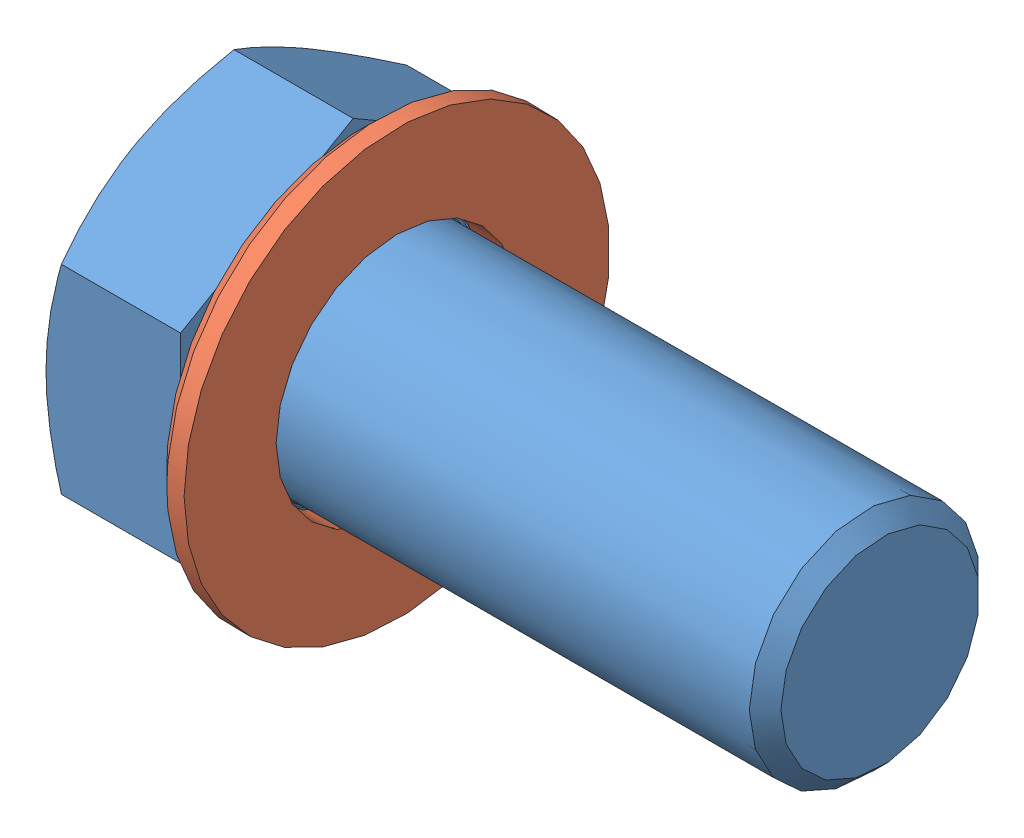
SolidWorks assembly Assemblage2.sldasm, configuration Défaut (file format 3400). Lengths in mm.
Overall size (57.5 37 37).
2 component instances, 2 part files, 2 mates.
Components (placement in the parent):
- Vis M20 45mm-1: Vis M20 45mm.SLDPRT [ISO 4017 - M20 x 45-N] at origin size (57.5 34.64 30)
- Rondelle M20-1: Rondelle M20.SLDPRT [Washer ISO 7090 - 20] at (15.5 0 0) size (3 37 37)
Mates (geometry in assembly coordinates):
- Coaxiale11: concentric: cylinder of ?; cylinder of ?
- Coïncidente1: coincident anti-aligned: plane of ?; plane of ?
